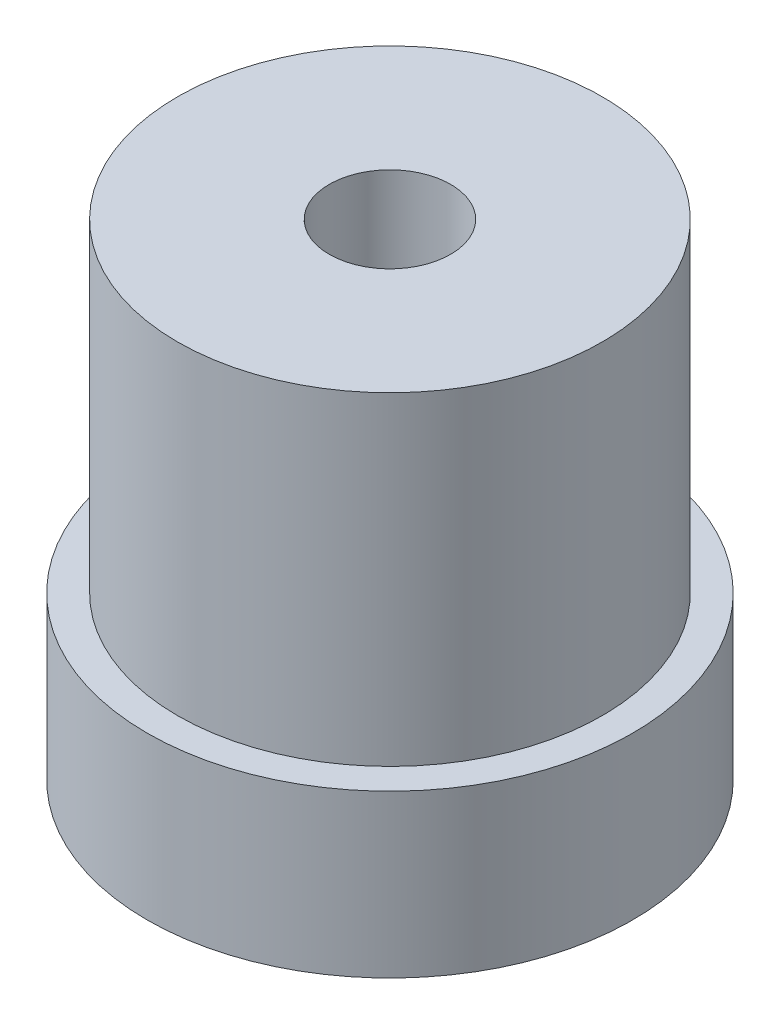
from build123d import *

# Parameters (mm, degrees)
SKETCH1_R           = 76.2
BOSS_EXTRUDE1_DEPTH = 50.8
SKETCH2_R           = 66.675
BOSS_EXTRUDE2_DEPTH = 101.6
SKETCH3_R           = 19.05
CUT_EXTRUDE1_DEPTH  = 38.1


with BuildPart() as part:
    # Sketch1 → Boss-Extrude1 (new body)
    with BuildSketch(Plane(origin=(0, 0, 0), x_dir=(1, 0, 0), z_dir=(0, 1, 0))):
        with Locations(Location((0, 0, 0), (0, 0, 270))):
            Circle(SKETCH1_R)
    extrude(amount=BOSS_EXTRUDE1_DEPTH)

    # Sketch2 → Boss-Extrude2 (add)
    with BuildSketch(Plane(origin=(0, 50.8, 0), x_dir=(1, 0, 0), z_dir=(0, 1, 0))):
        with Locations(Location((0, 0, 0), (0, 0, 270))):
            Circle(SKETCH2_R)
    extrude(amount=BOSS_EXTRUDE2_DEPTH)

    # Sketch3 → Cut-Extrude1 (cut)
    with BuildSketch(Plane(origin=(0, 152.4, 0), x_dir=(1, 0, 0), z_dir=(0, 1, 0))):
        with Locations(Location((0, 0, 0), (0, 0, 270))):
            Circle(SKETCH3_R)
    extrude(amount=-CUT_EXTRUDE1_DEPTH, mode=Mode.SUBTRACT)


solid = part.part
